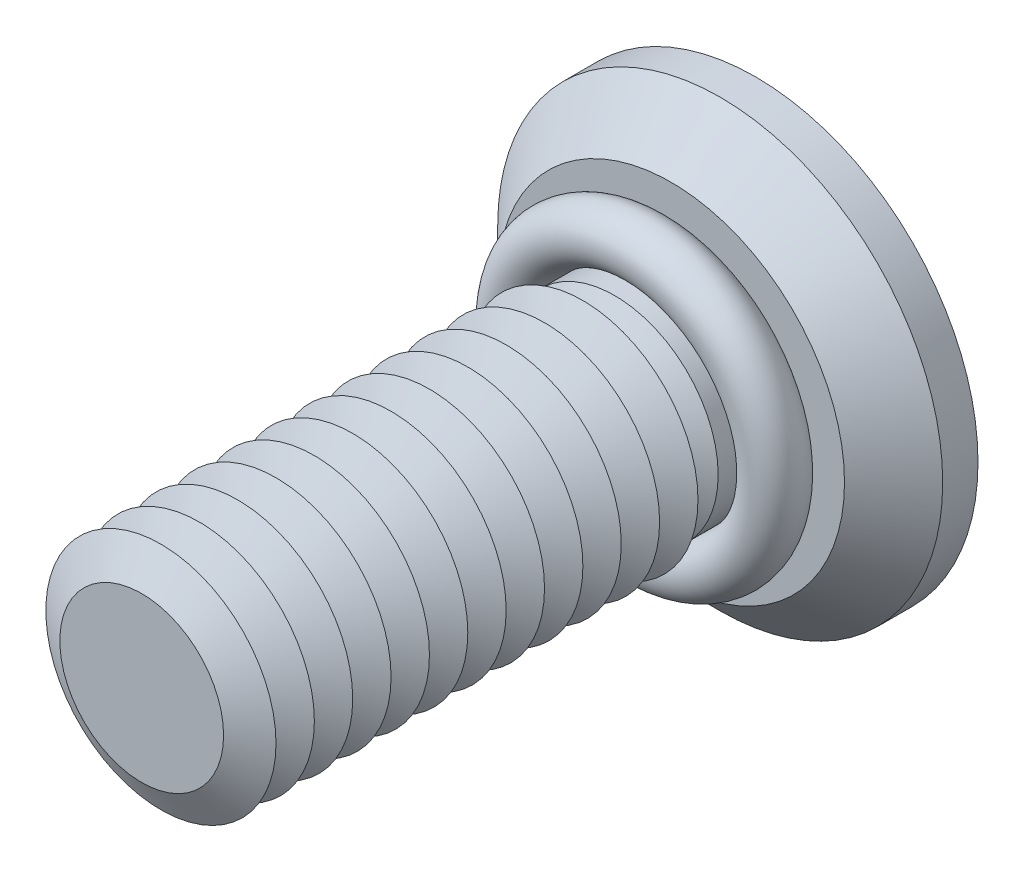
ISO-10303-21;
HEADER;
FILE_DESCRIPTION(('STEP AP214'),'2;1');
FILE_NAME('part.step','',(''),(''),'','','');
FILE_SCHEMA(('AUTOMOTIVE_DESIGN { 1 0 10303 214 1 1 1 1 }'));
ENDSEC;
DATA;
#1=APPLICATION_CONTEXT('core data for automotive mechanical design processes');
#2=APPLICATION_PROTOCOL_DEFINITION('international standard','automotive_design',2000,#1);
#3=PRODUCT_CONTEXT('',#1,'mechanical');
#4=PRODUCT('Part','Part','',(#3));
#5=PRODUCT_RELATED_PRODUCT_CATEGORY('part','',(#4));
#6=PRODUCT_DEFINITION_FORMATION('','',#4);
#7=PRODUCT_DEFINITION_CONTEXT('part definition',#1,'design');
#8=PRODUCT_DEFINITION('design','',#6,#7);
#9=PRODUCT_DEFINITION_SHAPE('','',#8);
#10=(LENGTH_UNIT() NAMED_UNIT(*) SI_UNIT(.MILLI.,.METRE.));
#11=(NAMED_UNIT(*) PLANE_ANGLE_UNIT() SI_UNIT($,.RADIAN.));
#12=(NAMED_UNIT(*) SI_UNIT($,.STERADIAN.) SOLID_ANGLE_UNIT());
#13=UNCERTAINTY_MEASURE_WITH_UNIT(LENGTH_MEASURE(1.E-05),#10,'distance_accuracy_value','');
#14=(GEOMETRIC_REPRESENTATION_CONTEXT(3) GLOBAL_UNCERTAINTY_ASSIGNED_CONTEXT((#13)) GLOBAL_UNIT_ASSIGNED_CONTEXT((#10,
#11,#12)) REPRESENTATION_CONTEXT('',''));
#15=CARTESIAN_POINT('',(0.,0.,0.));
#16=DIRECTION('',(0.,0.,1.));
#17=DIRECTION('',(1.,0.,0.));
#18=AXIS2_PLACEMENT_3D('',#15,#16,#17);
#19=CARTESIAN_POINT('',(0.,0.,1.45));
#20=DIRECTION('',(0.,0.,1.));
#21=DIRECTION('',(1.,0.,0.));
#22=AXIS2_PLACEMENT_3D('',#19,#20,#21);
#23=TOROIDAL_SURFACE('',#22,1.7,0.35);
#24=CARTESIAN_POINT('',(0.,1.7,1.45));
#25=DIRECTION('',(1.,0.,0.));
#26=DIRECTION('',(0.,0.,-1.));
#27=AXIS2_PLACEMENT_3D('',#24,#25,#26);
#28=CIRCLE('',#27,0.35);
#29=CARTESIAN_POINT('',(0.,2.05,1.45));
#30=VERTEX_POINT('',#29);
#31=EDGE_CURVE('P0_E10',#30,#30,#28,.T.);
#32=CARTESIAN_POINT('',(0.,0.,1.45));
#33=DIRECTION('',(0.,0.,1.));
#34=DIRECTION('',(1.,0.,0.));
#35=AXIS2_PLACEMENT_3D('',#32,#33,#34);
#36=CIRCLE('',#35,2.05);
#37=EDGE_CURVE('',#30,#30,#36,.T.);
#38=ORIENTED_EDGE('',*,*,#31,.F.);
#39=ORIENTED_EDGE('',*,*,#31,.T.);
#40=ORIENTED_EDGE('',*,*,#37,.T.);
#41=ORIENTED_EDGE('',*,*,#37,.F.);
#42=EDGE_LOOP('',(#38,#40,#39,#41));
#43=FACE_BOUND('',#42,.T.);
#44=ADVANCED_FACE('P0_F14',(#43),#23,.T.);
#45=CLOSED_SHELL('',(#44));
#46=MANIFOLD_SOLID_BREP('P0_B1',#45);
#47=CARTESIAN_POINT('',(0.,0.,5.5));
#48=DIRECTION('',(0.,0.,-1.));
#49=DIRECTION('',(-1.,0.,0.));
#50=AXIS2_PLACEMENT_3D('',#47,#48,#49);
#51=CONICAL_SURFACE('',#50,1.06698729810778,1.0471975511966);
#52=CARTESIAN_POINT('',(0.,0.,5.25));
#53=DIRECTION('',(0.,0.,1.));
#54=DIRECTION('',(1.,0.,0.));
#55=AXIS2_PLACEMENT_3D('',#52,#53,#54);
#56=CIRCLE('',#55,1.5);
#57=CARTESIAN_POINT('',(1.5,0.,5.25));
#58=VERTEX_POINT('',#57);
#59=EDGE_CURVE('P1_E324',#58,#58,#56,.T.);
#60=ORIENTED_EDGE('',*,*,#59,.T.);
#61=EDGE_LOOP('',(#60));
#62=FACE_BOUND('',#61,.T.);
#63=CARTESIAN_POINT('',(0.,0.,5.5));
#64=DIRECTION('',(0.,0.,1.));
#65=DIRECTION('',(1.,0.,0.));
#66=AXIS2_PLACEMENT_3D('',#63,#64,#65);
#67=CIRCLE('',#66,1.06698729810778);
#68=CARTESIAN_POINT('',(1.06698729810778,0.,5.5));
#69=VERTEX_POINT('',#68);
#70=EDGE_CURVE('P1_E321',#69,#69,#67,.T.);
#71=ORIENTED_EDGE('',*,*,#70,.F.);
#72=EDGE_LOOP('',(#71));
#73=FACE_BOUND('',#72,.T.);
#74=ADVANCED_FACE('P1_F15',(#62,#73),#51,.T.);
#75=CARTESIAN_POINT('',(0.,0.,5.75));
#76=DIRECTION('',(0.,0.,1.));
#77=DIRECTION('',(1.,0.,0.));
#78=AXIS2_PLACEMENT_3D('',#75,#76,#77);
#79=CONICAL_SURFACE('',#78,1.5,1.0471975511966);
#80=ORIENTED_EDGE('',*,*,#70,.T.);
#81=EDGE_LOOP('',(#80));
#82=FACE_BOUND('',#81,.T.);
#83=CARTESIAN_POINT('',(0.,0.,5.75));
#84=DIRECTION('',(0.,0.,1.));
#85=DIRECTION('',(1.,0.,0.));
#86=AXIS2_PLACEMENT_3D('',#83,#84,#85);
#87=CIRCLE('',#86,1.5);
#88=CARTESIAN_POINT('',(1.5,0.,5.75));
#89=VERTEX_POINT('',#88);
#90=EDGE_CURVE('P1_E318',#89,#89,#87,.T.);
#91=ORIENTED_EDGE('',*,*,#90,.F.);
#92=EDGE_LOOP('',(#91));
#93=FACE_BOUND('',#92,.T.);
#94=ADVANCED_FACE('P1_F245',(#82,#93),#79,.T.);
#95=CARTESIAN_POINT('',(0.,0.,8.));
#96=DIRECTION('',(0.,0.,1.));
#97=DIRECTION('',(1.,0.,0.));
#98=AXIS2_PLACEMENT_3D('',#95,#96,#97);
#99=PLANE('',#98);
#100=CARTESIAN_POINT('',(0.,0.,8.));
#101=DIRECTION('',(0.,0.,1.));
#102=DIRECTION('',(1.,0.,0.));
#103=AXIS2_PLACEMENT_3D('',#100,#101,#102);
#104=CIRCLE('',#103,1.06698729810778);
#105=CARTESIAN_POINT('',(1.06698729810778,0.,8.));
#106=VERTEX_POINT('',#105);
#107=EDGE_CURVE('P1_E131',#106,#106,#104,.T.);
#108=ORIENTED_EDGE('',*,*,#107,.T.);
#109=EDGE_LOOP('',(#108));
#110=FACE_BOUND('',#109,.T.);
#111=ADVANCED_FACE('P1_F251',(#110),#99,.T.);
#112=CARTESIAN_POINT('',(0.,0.,8.));
#113=DIRECTION('',(0.,0.,-1.));
#114=DIRECTION('',(-1.,0.,0.));
#115=AXIS2_PLACEMENT_3D('',#112,#113,#114);
#116=CONICAL_SURFACE('',#115,1.06698729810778,1.0471975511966);
#117=CARTESIAN_POINT('',(0.,0.,7.75));
#118=DIRECTION('',(0.,0.,1.));
#119=DIRECTION('',(1.,0.,0.));
#120=AXIS2_PLACEMENT_3D('',#117,#118,#119);
#121=CIRCLE('',#120,1.5);
#122=CARTESIAN_POINT('',(1.5,0.,7.75));
#123=VERTEX_POINT('',#122);
#124=EDGE_CURVE('P1_E133',#123,#123,#121,.T.);
#125=ORIENTED_EDGE('',*,*,#124,.T.);
#126=EDGE_LOOP('',(#125));
#127=FACE_BOUND('',#126,.T.);
#128=ORIENTED_EDGE('',*,*,#107,.F.);
#129=EDGE_LOOP('',(#128));
#130=FACE_BOUND('',#129,.T.);
#131=ADVANCED_FACE('P1_F196',(#127,#130),#116,.T.);
#132=CARTESIAN_POINT('',(0.,0.,7.75));
#133=DIRECTION('',(0.,0.,1.));
#134=DIRECTION('',(1.,0.,0.));
#135=AXIS2_PLACEMENT_3D('',#132,#133,#134);
#136=CONICAL_SURFACE('',#135,1.5,1.0471975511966);
#137=CARTESIAN_POINT('',(0.,0.,7.5));
#138=DIRECTION('',(0.,0.,1.));
#139=DIRECTION('',(1.,0.,0.));
#140=AXIS2_PLACEMENT_3D('',#137,#138,#139);
#141=CIRCLE('',#140,1.06698729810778);
#142=CARTESIAN_POINT('',(1.06698729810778,0.,7.5));
#143=VERTEX_POINT('',#142);
#144=EDGE_CURVE('P1_E297',#143,#143,#141,.T.);
#145=ORIENTED_EDGE('',*,*,#144,.T.);
#146=EDGE_LOOP('',(#145));
#147=FACE_BOUND('',#146,.T.);
#148=ORIENTED_EDGE('',*,*,#124,.F.);
#149=EDGE_LOOP('',(#148));
#150=FACE_BOUND('',#149,.T.);
#151=ADVANCED_FACE('P1_F284',(#147,#150),#136,.T.);
#152=CARTESIAN_POINT('',(0.,0.,7.5));
#153=DIRECTION('',(0.,0.,-1.));
#154=DIRECTION('',(-1.,0.,0.));
#155=AXIS2_PLACEMENT_3D('',#152,#153,#154);
#156=CONICAL_SURFACE('',#155,1.06698729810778,1.0471975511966);
#157=CARTESIAN_POINT('',(0.,0.,7.25));
#158=DIRECTION('',(0.,0.,1.));
#159=DIRECTION('',(1.,0.,0.));
#160=AXIS2_PLACEMENT_3D('',#157,#158,#159);
#161=CIRCLE('',#160,1.5);
#162=CARTESIAN_POINT('',(1.5,0.,7.25));
#163=VERTEX_POINT('',#162);
#164=EDGE_CURVE('P1_E294',#163,#163,#161,.T.);
#165=ORIENTED_EDGE('',*,*,#164,.T.);
#166=EDGE_LOOP('',(#165));
#167=FACE_BOUND('',#166,.T.);
#168=ORIENTED_EDGE('',*,*,#144,.F.);
#169=EDGE_LOOP('',(#168));
#170=FACE_BOUND('',#169,.T.);
#171=ADVANCED_FACE('P1_F279',(#167,#170),#156,.T.);
#172=CARTESIAN_POINT('',(0.,0.,7.25));
#173=DIRECTION('',(0.,0.,1.));
#174=DIRECTION('',(1.,0.,0.));
#175=AXIS2_PLACEMENT_3D('',#172,#173,#174);
#176=CONICAL_SURFACE('',#175,1.5,1.0471975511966);
#177=CARTESIAN_POINT('',(0.,0.,7.));
#178=DIRECTION('',(0.,0.,1.));
#179=DIRECTION('',(1.,0.,0.));
#180=AXIS2_PLACEMENT_3D('',#177,#178,#179);
#181=CIRCLE('',#180,1.06698729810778);
#182=CARTESIAN_POINT('',(1.06698729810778,0.,7.));
#183=VERTEX_POINT('',#182);
#184=EDGE_CURVE('P1_E301',#183,#183,#181,.T.);
#185=ORIENTED_EDGE('',*,*,#184,.T.);
#186=EDGE_LOOP('',(#185));
#187=FACE_BOUND('',#186,.T.);
#188=ORIENTED_EDGE('',*,*,#164,.F.);
#189=EDGE_LOOP('',(#188));
#190=FACE_BOUND('',#189,.T.);
#191=ADVANCED_FACE('P1_F276',(#187,#190),#176,.T.);
#192=CARTESIAN_POINT('',(0.,0.,7.));
#193=DIRECTION('',(0.,0.,-1.));
#194=DIRECTION('',(-1.,0.,0.));
#195=AXIS2_PLACEMENT_3D('',#192,#193,#194);
#196=CONICAL_SURFACE('',#195,1.06698729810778,1.0471975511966);
#197=CARTESIAN_POINT('',(0.,0.,6.75));
#198=DIRECTION('',(0.,0.,1.));
#199=DIRECTION('',(1.,0.,0.));
#200=AXIS2_PLACEMENT_3D('',#197,#198,#199);
#201=CIRCLE('',#200,1.5);
#202=CARTESIAN_POINT('',(1.5,0.,6.75));
#203=VERTEX_POINT('',#202);
#204=EDGE_CURVE('P1_E306',#203,#203,#201,.T.);
#205=ORIENTED_EDGE('',*,*,#204,.T.);
#206=EDGE_LOOP('',(#205));
#207=FACE_BOUND('',#206,.T.);
#208=ORIENTED_EDGE('',*,*,#184,.F.);
#209=EDGE_LOOP('',(#208));
#210=FACE_BOUND('',#209,.T.);
#211=ADVANCED_FACE('P1_F271',(#207,#210),#196,.T.);
#212=CARTESIAN_POINT('',(0.,0.,6.75));
#213=DIRECTION('',(0.,0.,1.));
#214=DIRECTION('',(1.,0.,0.));
#215=AXIS2_PLACEMENT_3D('',#212,#213,#214);
#216=CONICAL_SURFACE('',#215,1.5,1.0471975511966);
#217=CARTESIAN_POINT('',(0.,0.,6.5));
#218=DIRECTION('',(0.,0.,1.));
#219=DIRECTION('',(1.,0.,0.));
#220=AXIS2_PLACEMENT_3D('',#217,#218,#219);
#221=CIRCLE('',#220,1.06698729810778);
#222=CARTESIAN_POINT('',(1.06698729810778,0.,6.5));
#223=VERTEX_POINT('',#222);
#224=EDGE_CURVE('P1_E309',#223,#223,#221,.T.);
#225=ORIENTED_EDGE('',*,*,#224,.T.);
#226=EDGE_LOOP('',(#225));
#227=FACE_BOUND('',#226,.T.);
#228=ORIENTED_EDGE('',*,*,#204,.F.);
#229=EDGE_LOOP('',(#228));
#230=FACE_BOUND('',#229,.T.);
#231=ADVANCED_FACE('P1_F268',(#227,#230),#216,.T.);
#232=CARTESIAN_POINT('',(0.,0.,6.5));
#233=DIRECTION('',(0.,0.,-1.));
#234=DIRECTION('',(-1.,0.,0.));
#235=AXIS2_PLACEMENT_3D('',#232,#233,#234);
#236=CONICAL_SURFACE('',#235,1.06698729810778,1.0471975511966);
#237=CARTESIAN_POINT('',(0.,0.,6.25));
#238=DIRECTION('',(0.,0.,1.));
#239=DIRECTION('',(1.,0.,0.));
#240=AXIS2_PLACEMENT_3D('',#237,#238,#239);
#241=CIRCLE('',#240,1.5);
#242=CARTESIAN_POINT('',(1.5,0.,6.25));
#243=VERTEX_POINT('',#242);
#244=EDGE_CURVE('P1_E312',#243,#243,#241,.T.);
#245=ORIENTED_EDGE('',*,*,#244,.T.);
#246=EDGE_LOOP('',(#245));
#247=FACE_BOUND('',#246,.T.);
#248=ORIENTED_EDGE('',*,*,#224,.F.);
#249=EDGE_LOOP('',(#248));
#250=FACE_BOUND('',#249,.T.);
#251=ADVANCED_FACE('P1_F262',(#247,#250),#236,.T.);
#252=CARTESIAN_POINT('',(0.,0.,6.25));
#253=DIRECTION('',(0.,0.,1.));
#254=DIRECTION('',(1.,0.,0.));
#255=AXIS2_PLACEMENT_3D('',#252,#253,#254);
#256=CONICAL_SURFACE('',#255,1.5,1.0471975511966);
#257=CARTESIAN_POINT('',(0.,0.,6.));
#258=DIRECTION('',(0.,0.,1.));
#259=DIRECTION('',(1.,0.,0.));
#260=AXIS2_PLACEMENT_3D('',#257,#258,#259);
#261=CIRCLE('',#260,1.06698729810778);
#262=CARTESIAN_POINT('',(1.06698729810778,0.,6.));
#263=VERTEX_POINT('',#262);
#264=EDGE_CURVE('P1_E315',#263,#263,#261,.T.);
#265=ORIENTED_EDGE('',*,*,#264,.T.);
#266=EDGE_LOOP('',(#265));
#267=FACE_BOUND('',#266,.T.);
#268=ORIENTED_EDGE('',*,*,#244,.F.);
#269=EDGE_LOOP('',(#268));
#270=FACE_BOUND('',#269,.T.);
#271=ADVANCED_FACE('P1_F258',(#267,#270),#256,.T.);
#272=CARTESIAN_POINT('',(0.,0.,6.));
#273=DIRECTION('',(0.,0.,-1.));
#274=DIRECTION('',(-1.,0.,0.));
#275=AXIS2_PLACEMENT_3D('',#272,#273,#274);
#276=CONICAL_SURFACE('',#275,1.06698729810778,1.0471975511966);
#277=ORIENTED_EDGE('',*,*,#90,.T.);
#278=EDGE_LOOP('',(#277));
#279=FACE_BOUND('',#278,.T.);
#280=ORIENTED_EDGE('',*,*,#264,.F.);
#281=EDGE_LOOP('',(#280));
#282=FACE_BOUND('',#281,.T.);
#283=ADVANCED_FACE('P1_F261',(#279,#282),#276,.T.);
#284=CARTESIAN_POINT('',(0.,0.,5.));
#285=DIRECTION('',(0.,0.,-1.));
#286=DIRECTION('',(-1.,0.,0.));
#287=AXIS2_PLACEMENT_3D('',#284,#285,#286);
#288=CONICAL_SURFACE('',#287,1.06698729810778,1.0471975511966);
#289=CARTESIAN_POINT('',(0.,0.,4.75));
#290=DIRECTION('',(0.,0.,1.));
#291=DIRECTION('',(1.,0.,0.));
#292=AXIS2_PLACEMENT_3D('',#289,#290,#291);
#293=CIRCLE('',#292,1.5);
#294=CARTESIAN_POINT('',(1.5,0.,4.75));
#295=VERTEX_POINT('',#294);
#296=EDGE_CURVE('P1_E329',#295,#295,#293,.T.);
#297=ORIENTED_EDGE('',*,*,#296,.T.);
#298=EDGE_LOOP('',(#297));
#299=FACE_BOUND('',#298,.T.);
#300=CARTESIAN_POINT('',(0.,0.,5.));
#301=DIRECTION('',(0.,0.,1.));
#302=DIRECTION('',(1.,0.,0.));
#303=AXIS2_PLACEMENT_3D('',#300,#301,#302);
#304=CIRCLE('',#303,1.06698729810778);
#305=CARTESIAN_POINT('',(1.06698729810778,0.,5.));
#306=VERTEX_POINT('',#305);
#307=EDGE_CURVE('P1_E326',#306,#306,#304,.T.);
#308=ORIENTED_EDGE('',*,*,#307,.F.);
#309=EDGE_LOOP('',(#308));
#310=FACE_BOUND('',#309,.T.);
#311=ADVANCED_FACE('P1_F266',(#299,#310),#288,.T.);
#312=CARTESIAN_POINT('',(0.,0.,5.25));
#313=DIRECTION('',(0.,0.,1.));
#314=DIRECTION('',(1.,0.,0.));
#315=AXIS2_PLACEMENT_3D('',#312,#313,#314);
#316=CONICAL_SURFACE('',#315,1.5,1.0471975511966);
#317=ORIENTED_EDGE('',*,*,#307,.T.);
#318=EDGE_LOOP('',(#317));
#319=FACE_BOUND('',#318,.T.);
#320=ORIENTED_EDGE('',*,*,#59,.F.);
#321=EDGE_LOOP('',(#320));
#322=FACE_BOUND('',#321,.T.);
#323=ADVANCED_FACE('P1_F467',(#319,#322),#316,.T.);
#324=CARTESIAN_POINT('',(0.,0.,4.5));
#325=DIRECTION('',(0.,0.,-1.));
#326=DIRECTION('',(-1.,0.,0.));
#327=AXIS2_PLACEMENT_3D('',#324,#325,#326);
#328=CONICAL_SURFACE('',#327,1.06698729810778,1.0471975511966);
#329=CARTESIAN_POINT('',(0.,0.,4.25));
#330=DIRECTION('',(0.,0.,1.));
#331=DIRECTION('',(1.,0.,0.));
#332=AXIS2_PLACEMENT_3D('',#329,#330,#331);
#333=CIRCLE('',#332,1.5);
#334=CARTESIAN_POINT('',(1.5,0.,4.25));
#335=VERTEX_POINT('',#334);
#336=EDGE_CURVE('P1_E335',#335,#335,#333,.T.);
#337=ORIENTED_EDGE('',*,*,#336,.T.);
#338=EDGE_LOOP('',(#337));
#339=FACE_BOUND('',#338,.T.);
#340=CARTESIAN_POINT('',(0.,0.,4.5));
#341=DIRECTION('',(0.,0.,1.));
#342=DIRECTION('',(1.,0.,0.));
#343=AXIS2_PLACEMENT_3D('',#340,#341,#342);
#344=CIRCLE('',#343,1.06698729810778);
#345=CARTESIAN_POINT('',(1.06698729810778,0.,4.5));
#346=VERTEX_POINT('',#345);
#347=EDGE_CURVE('P1_E332',#346,#346,#344,.T.);
#348=ORIENTED_EDGE('',*,*,#347,.F.);
#349=EDGE_LOOP('',(#348));
#350=FACE_BOUND('',#349,.T.);
#351=ADVANCED_FACE('P1_F476',(#339,#350),#328,.T.);
#352=CARTESIAN_POINT('',(0.,0.,4.75));
#353=DIRECTION('',(0.,0.,1.));
#354=DIRECTION('',(1.,0.,0.));
#355=AXIS2_PLACEMENT_3D('',#352,#353,#354);
#356=CONICAL_SURFACE('',#355,1.5,1.0471975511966);
#357=ORIENTED_EDGE('',*,*,#347,.T.);
#358=EDGE_LOOP('',(#357));
#359=FACE_BOUND('',#358,.T.);
#360=ORIENTED_EDGE('',*,*,#296,.F.);
#361=EDGE_LOOP('',(#360));
#362=FACE_BOUND('',#361,.T.);
#363=ADVANCED_FACE('P1_F486',(#359,#362),#356,.T.);
#364=CARTESIAN_POINT('',(0.,0.,4.));
#365=DIRECTION('',(0.,0.,-1.));
#366=DIRECTION('',(-1.,0.,0.));
#367=AXIS2_PLACEMENT_3D('',#364,#365,#366);
#368=CONICAL_SURFACE('',#367,1.06698729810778,1.0471975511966);
#369=CARTESIAN_POINT('',(0.,0.,3.75));
#370=DIRECTION('',(0.,0.,1.));
#371=DIRECTION('',(1.,0.,0.));
#372=AXIS2_PLACEMENT_3D('',#369,#370,#371);
#373=CIRCLE('',#372,1.5);
#374=CARTESIAN_POINT('',(1.5,0.,3.75));
#375=VERTEX_POINT('',#374);
#376=EDGE_CURVE('P1_E341',#375,#375,#373,.T.);
#377=ORIENTED_EDGE('',*,*,#376,.T.);
#378=EDGE_LOOP('',(#377));
#379=FACE_BOUND('',#378,.T.);
#380=CARTESIAN_POINT('',(0.,0.,4.));
#381=DIRECTION('',(0.,0.,1.));
#382=DIRECTION('',(1.,0.,0.));
#383=AXIS2_PLACEMENT_3D('',#380,#381,#382);
#384=CIRCLE('',#383,1.06698729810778);
#385=CARTESIAN_POINT('',(1.06698729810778,0.,4.));
#386=VERTEX_POINT('',#385);
#387=EDGE_CURVE('P1_E338',#386,#386,#384,.T.);
#388=ORIENTED_EDGE('',*,*,#387,.F.);
#389=EDGE_LOOP('',(#388));
#390=FACE_BOUND('',#389,.T.);
#391=ADVANCED_FACE('P1_F496',(#379,#390),#368,.T.);
#392=CARTESIAN_POINT('',(0.,0.,4.25));
#393=DIRECTION('',(0.,0.,1.));
#394=DIRECTION('',(1.,0.,0.));
#395=AXIS2_PLACEMENT_3D('',#392,#393,#394);
#396=CONICAL_SURFACE('',#395,1.5,1.0471975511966);
#397=ORIENTED_EDGE('',*,*,#387,.T.);
#398=EDGE_LOOP('',(#397));
#399=FACE_BOUND('',#398,.T.);
#400=ORIENTED_EDGE('',*,*,#336,.F.);
#401=EDGE_LOOP('',(#400));
#402=FACE_BOUND('',#401,.T.);
#403=ADVANCED_FACE('P1_F506',(#399,#402),#396,.T.);
#404=CARTESIAN_POINT('',(0.,0.,3.5));
#405=DIRECTION('',(0.,0.,-1.));
#406=DIRECTION('',(-1.,0.,0.));
#407=AXIS2_PLACEMENT_3D('',#404,#405,#406);
#408=CONICAL_SURFACE('',#407,1.06698729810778,1.0471975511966);
#409=CARTESIAN_POINT('',(0.,0.,3.25));
#410=DIRECTION('',(0.,0.,1.));
#411=DIRECTION('',(1.,0.,0.));
#412=AXIS2_PLACEMENT_3D('',#409,#410,#411);
#413=CIRCLE('',#412,1.5);
#414=CARTESIAN_POINT('',(1.5,0.,3.25));
#415=VERTEX_POINT('',#414);
#416=EDGE_CURVE('P1_E347',#415,#415,#413,.T.);
#417=ORIENTED_EDGE('',*,*,#416,.T.);
#418=EDGE_LOOP('',(#417));
#419=FACE_BOUND('',#418,.T.);
#420=CARTESIAN_POINT('',(0.,0.,3.5));
#421=DIRECTION('',(0.,0.,1.));
#422=DIRECTION('',(1.,0.,0.));
#423=AXIS2_PLACEMENT_3D('',#420,#421,#422);
#424=CIRCLE('',#423,1.06698729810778);
#425=CARTESIAN_POINT('',(1.06698729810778,0.,3.5));
#426=VERTEX_POINT('',#425);
#427=EDGE_CURVE('P1_E344',#426,#426,#424,.T.);
#428=ORIENTED_EDGE('',*,*,#427,.F.);
#429=EDGE_LOOP('',(#428));
#430=FACE_BOUND('',#429,.T.);
#431=ADVANCED_FACE('P1_F516',(#419,#430),#408,.T.);
#432=CARTESIAN_POINT('',(0.,0.,3.75));
#433=DIRECTION('',(0.,0.,1.));
#434=DIRECTION('',(1.,0.,0.));
#435=AXIS2_PLACEMENT_3D('',#432,#433,#434);
#436=CONICAL_SURFACE('',#435,1.5,1.0471975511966);
#437=ORIENTED_EDGE('',*,*,#427,.T.);
#438=EDGE_LOOP('',(#437));
#439=FACE_BOUND('',#438,.T.);
#440=ORIENTED_EDGE('',*,*,#376,.F.);
#441=EDGE_LOOP('',(#440));
#442=FACE_BOUND('',#441,.T.);
#443=ADVANCED_FACE('P1_F526',(#439,#442),#436,.T.);
#444=CARTESIAN_POINT('',(0.,0.,3.));
#445=DIRECTION('',(0.,0.,-1.));
#446=DIRECTION('',(-1.,0.,0.));
#447=AXIS2_PLACEMENT_3D('',#444,#445,#446);
#448=CONICAL_SURFACE('',#447,1.06698729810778,1.0471975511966);
#449=CARTESIAN_POINT('',(0.,0.,2.75));
#450=DIRECTION('',(0.,0.,1.));
#451=DIRECTION('',(1.,0.,0.));
#452=AXIS2_PLACEMENT_3D('',#449,#450,#451);
#453=CIRCLE('',#452,1.5);
#454=CARTESIAN_POINT('',(1.5,0.,2.75));
#455=VERTEX_POINT('',#454);
#456=EDGE_CURVE('P1_E353',#455,#455,#453,.T.);
#457=ORIENTED_EDGE('',*,*,#456,.T.);
#458=EDGE_LOOP('',(#457));
#459=FACE_BOUND('',#458,.T.);
#460=CARTESIAN_POINT('',(0.,0.,3.));
#461=DIRECTION('',(0.,0.,1.));
#462=DIRECTION('',(1.,0.,0.));
#463=AXIS2_PLACEMENT_3D('',#460,#461,#462);
#464=CIRCLE('',#463,1.06698729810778);
#465=CARTESIAN_POINT('',(1.06698729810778,0.,3.));
#466=VERTEX_POINT('',#465);
#467=EDGE_CURVE('P1_E350',#466,#466,#464,.T.);
#468=ORIENTED_EDGE('',*,*,#467,.F.);
#469=EDGE_LOOP('',(#468));
#470=FACE_BOUND('',#469,.T.);
#471=ADVANCED_FACE('P1_F536',(#459,#470),#448,.T.);
#472=CARTESIAN_POINT('',(0.,0.,3.25));
#473=DIRECTION('',(0.,0.,1.));
#474=DIRECTION('',(1.,0.,0.));
#475=AXIS2_PLACEMENT_3D('',#472,#473,#474);
#476=CONICAL_SURFACE('',#475,1.5,1.0471975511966);
#477=ORIENTED_EDGE('',*,*,#467,.T.);
#478=EDGE_LOOP('',(#477));
#479=FACE_BOUND('',#478,.T.);
#480=ORIENTED_EDGE('',*,*,#416,.F.);
#481=EDGE_LOOP('',(#480));
#482=FACE_BOUND('',#481,.T.);
#483=ADVANCED_FACE('P1_F546',(#479,#482),#476,.T.);
#484=CARTESIAN_POINT('',(0.,0.,2.5));
#485=DIRECTION('',(0.,0.,-1.));
#486=DIRECTION('',(-1.,0.,0.));
#487=AXIS2_PLACEMENT_3D('',#484,#485,#486);
#488=CONICAL_SURFACE('',#487,1.06698729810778,1.0471975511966);
#489=CARTESIAN_POINT('',(0.,0.,2.25));
#490=DIRECTION('',(0.,0.,1.));
#491=DIRECTION('',(1.,0.,0.));
#492=AXIS2_PLACEMENT_3D('',#489,#490,#491);
#493=CIRCLE('',#492,1.5);
#494=CARTESIAN_POINT('',(1.5,0.,2.25));
#495=VERTEX_POINT('',#494);
#496=EDGE_CURVE('P1_E359',#495,#495,#493,.T.);
#497=ORIENTED_EDGE('',*,*,#496,.T.);
#498=EDGE_LOOP('',(#497));
#499=FACE_BOUND('',#498,.T.);
#500=CARTESIAN_POINT('',(0.,0.,2.5));
#501=DIRECTION('',(0.,0.,1.));
#502=DIRECTION('',(1.,0.,0.));
#503=AXIS2_PLACEMENT_3D('',#500,#501,#502);
#504=CIRCLE('',#503,1.06698729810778);
#505=CARTESIAN_POINT('',(1.06698729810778,0.,2.5));
#506=VERTEX_POINT('',#505);
#507=EDGE_CURVE('P1_E356',#506,#506,#504,.T.);
#508=ORIENTED_EDGE('',*,*,#507,.F.);
#509=EDGE_LOOP('',(#508));
#510=FACE_BOUND('',#509,.T.);
#511=ADVANCED_FACE('P1_F556',(#499,#510),#488,.T.);
#512=CARTESIAN_POINT('',(0.,0.,2.75));
#513=DIRECTION('',(0.,0.,1.));
#514=DIRECTION('',(1.,0.,0.));
#515=AXIS2_PLACEMENT_3D('',#512,#513,#514);
#516=CONICAL_SURFACE('',#515,1.5,1.0471975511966);
#517=ORIENTED_EDGE('',*,*,#507,.T.);
#518=EDGE_LOOP('',(#517));
#519=FACE_BOUND('',#518,.T.);
#520=ORIENTED_EDGE('',*,*,#456,.F.);
#521=EDGE_LOOP('',(#520));
#522=FACE_BOUND('',#521,.T.);
#523=ADVANCED_FACE('P1_F372',(#519,#522),#516,.T.);
#524=CARTESIAN_POINT('',(0.,0.,2.));
#525=DIRECTION('',(0.,0.,-1.));
#526=DIRECTION('',(-1.,0.,0.));
#527=AXIS2_PLACEMENT_3D('',#524,#525,#526);
#528=CONICAL_SURFACE('',#527,1.06698729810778,1.0471975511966);
#529=CARTESIAN_POINT('',(0.,0.,2.));
#530=DIRECTION('',(0.,0.,1.));
#531=DIRECTION('',(1.,0.,0.));
#532=AXIS2_PLACEMENT_3D('',#529,#530,#531);
#533=CIRCLE('',#532,1.06698729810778);
#534=CARTESIAN_POINT('',(1.06698729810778,0.,2.));
#535=VERTEX_POINT('',#534);
#536=EDGE_CURVE('P1_E362',#535,#535,#533,.T.);
#537=ORIENTED_EDGE('',*,*,#536,.F.);
#538=EDGE_LOOP('',(#537));
#539=FACE_BOUND('',#538,.T.);
#540=CARTESIAN_POINT('',(0.,0.,1.83660254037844));
#541=DIRECTION('',(0.,0.,-1.));
#542=DIRECTION('',(-1.,0.,0.));
#543=AXIS2_PLACEMENT_3D('',#540,#541,#542);
#544=CIRCLE('',#543,1.35);
#545=CARTESIAN_POINT('',(-1.35,0.,1.83660254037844));
#546=VERTEX_POINT('',#545);
#547=EDGE_CURVE('P1_E19',#546,#546,#544,.F.);
#548=ORIENTED_EDGE('',*,*,#547,.T.);
#549=EDGE_LOOP('',(#548));
#550=FACE_BOUND('',#549,.T.);
#551=ADVANCED_FACE('P1_F369',(#539,#550),#528,.T.);
#552=CARTESIAN_POINT('',(0.,0.,2.25));
#553=DIRECTION('',(0.,0.,1.));
#554=DIRECTION('',(1.,0.,0.));
#555=AXIS2_PLACEMENT_3D('',#552,#553,#554);
#556=CONICAL_SURFACE('',#555,1.5,1.0471975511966);
#557=ORIENTED_EDGE('',*,*,#536,.T.);
#558=EDGE_LOOP('',(#557));
#559=FACE_BOUND('',#558,.T.);
#560=ORIENTED_EDGE('',*,*,#496,.F.);
#561=EDGE_LOOP('',(#560));
#562=FACE_BOUND('',#561,.T.);
#563=ADVANCED_FACE('P1_F366',(#559,#562),#556,.T.);
#564=CARTESIAN_POINT('',(0.,0.,1.2));
#565=DIRECTION('',(0.,0.,-1.));
#566=DIRECTION('',(-1.,0.,0.));
#567=AXIS2_PLACEMENT_3D('',#564,#565,#566);
#568=CONICAL_SURFACE('',#567,1.,1.0471975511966);
#569=CARTESIAN_POINT('',(0.,0.,1.77735026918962));
#570=VERTEX_POINT('',#569);
#571=VERTEX_LOOP('',#570);
#572=FACE_BOUND('',#571,.T.);
#573=CARTESIAN_POINT('',(0.,0.,1.2));
#574=DIRECTION('',(0.,0.,-1.));
#575=DIRECTION('',(-1.,0.,0.));
#576=AXIS2_PLACEMENT_3D('',#573,#574,#575);
#577=CIRCLE('',#576,1.);
#578=CARTESIAN_POINT('',(-1.,0.,1.2));
#579=VERTEX_POINT('',#578);
#580=CARTESIAN_POINT('',(-0.5,0.866025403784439,1.2));
#581=VERTEX_POINT('',#580);
#582=EDGE_CURVE('P1_E117',#579,#581,#577,.T.);
#583=ORIENTED_EDGE('',*,*,#582,.T.);
#584=CARTESIAN_POINT('',(0.,0.,1.2));
#585=DIRECTION('',(0.,0.,-1.));
#586=DIRECTION('',(-1.,0.,0.));
#587=AXIS2_PLACEMENT_3D('',#584,#585,#586);
#588=CIRCLE('',#587,1.);
#589=CARTESIAN_POINT('',(0.5,0.866025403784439,1.2));
#590=VERTEX_POINT('',#589);
#591=EDGE_CURVE('P1_E24',#581,#590,#588,.T.);
#592=ORIENTED_EDGE('',*,*,#591,.T.);
#593=CARTESIAN_POINT('',(1.,0.,1.2));
#594=VERTEX_POINT('',#593);
#595=EDGE_CURVE('P1_E791',#590,#594,#588,.T.);
#596=ORIENTED_EDGE('',*,*,#595,.T.);
#597=CARTESIAN_POINT('',(0.5,-0.866025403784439,1.2));
#598=VERTEX_POINT('',#597);
#599=EDGE_CURVE('P1_E784',#594,#598,#588,.T.);
#600=ORIENTED_EDGE('',*,*,#599,.T.);
#601=CARTESIAN_POINT('',(-0.499999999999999,-0.866025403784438,1.2));
#602=VERTEX_POINT('',#601);
#603=EDGE_CURVE('P1_E182',#598,#602,#588,.T.);
#604=ORIENTED_EDGE('',*,*,#603,.T.);
#605=EDGE_CURVE('P1_E179',#602,#579,#588,.T.);
#606=ORIENTED_EDGE('',*,*,#605,.T.);
#607=EDGE_LOOP('',(#583,#592,#596,#600,#604,#606));
#608=FACE_BOUND('',#607,.T.);
#609=ADVANCED_FACE('P1_F198',(#572,#608),#568,.F.);
#610=CARTESIAN_POINT('',(0.,0.,1.2));
#611=DIRECTION('',(0.,0.,-1.));
#612=DIRECTION('',(-1.,0.,0.));
#613=AXIS2_PLACEMENT_3D('',#610,#611,#612);
#614=PLANE('',#613);
#615=ORIENTED_EDGE('',*,*,#603,.F.);
#616=DIRECTION('',(-0.866025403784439,-0.5,0.));
#617=VECTOR('',#616,1.);
#618=CARTESIAN_POINT('',(1.,-0.577350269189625,1.2));
#619=LINE('',#618,#617);
#620=CARTESIAN_POINT('',(0.,-1.15470053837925,1.2));
#621=VERTEX_POINT('',#620);
#622=EDGE_CURVE('P1_E800',#598,#621,#619,.T.);
#623=ORIENTED_EDGE('',*,*,#622,.T.);
#624=DIRECTION('',(-0.866025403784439,0.5,0.));
#625=VECTOR('',#624,1.);
#626=CARTESIAN_POINT('',(0.,-1.15470053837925,1.2));
#627=LINE('',#626,#625);
#628=EDGE_CURVE('P1_E807',#621,#602,#627,.T.);
#629=ORIENTED_EDGE('',*,*,#628,.T.);
#630=EDGE_LOOP('',(#615,#623,#629));
#631=FACE_BOUND('',#630,.T.);
#632=ADVANCED_FACE('P1_F598',(#631),#614,.T.);
#633=ORIENTED_EDGE('',*,*,#605,.F.);
#634=CARTESIAN_POINT('',(-1.,-0.577350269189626,1.2));
#635=VERTEX_POINT('',#634);
#636=EDGE_CURVE('P1_E810',#602,#635,#627,.T.);
#637=ORIENTED_EDGE('',*,*,#636,.T.);
#638=DIRECTION('',(0.,1.,0.));
#639=VECTOR('',#638,1.);
#640=CARTESIAN_POINT('',(-1.,-0.577350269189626,1.2));
#641=LINE('',#640,#639);
#642=EDGE_CURVE('P1_E123',#635,#579,#641,.T.);
#643=ORIENTED_EDGE('',*,*,#642,.T.);
#644=EDGE_LOOP('',(#633,#637,#643));
#645=FACE_BOUND('',#644,.T.);
#646=ADVANCED_FACE('P1_F231',(#645),#614,.T.);
#647=ORIENTED_EDGE('',*,*,#582,.F.);
#648=CARTESIAN_POINT('',(-0.999999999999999,0.577350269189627,1.2));
#649=VERTEX_POINT('',#648);
#650=EDGE_CURVE('P1_E812',#579,#649,#641,.T.);
#651=ORIENTED_EDGE('',*,*,#650,.T.);
#652=DIRECTION('',(0.866025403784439,0.5,0.));
#653=VECTOR('',#652,1.);
#654=CARTESIAN_POINT('',(-0.999999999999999,0.577350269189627,1.2));
#655=LINE('',#654,#653);
#656=EDGE_CURVE('P1_E815',#649,#581,#655,.T.);
#657=ORIENTED_EDGE('',*,*,#656,.T.);
#658=EDGE_LOOP('',(#647,#651,#657));
#659=FACE_BOUND('',#658,.T.);
#660=ADVANCED_FACE('P1_F615',(#659),#614,.T.);
#661=ORIENTED_EDGE('',*,*,#591,.F.);
#662=CARTESIAN_POINT('',(0.,1.15470053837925,1.2));
#663=VERTEX_POINT('',#662);
#664=EDGE_CURVE('P1_E814',#581,#663,#655,.T.);
#665=ORIENTED_EDGE('',*,*,#664,.T.);
#666=DIRECTION('',(0.866025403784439,-0.5,0.));
#667=VECTOR('',#666,1.);
#668=CARTESIAN_POINT('',(0.,1.15470053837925,1.2));
#669=LINE('',#668,#667);
#670=EDGE_CURVE('P1_E161',#663,#590,#669,.T.);
#671=ORIENTED_EDGE('',*,*,#670,.T.);
#672=EDGE_LOOP('',(#661,#665,#671));
#673=FACE_BOUND('',#672,.T.);
#674=ADVANCED_FACE('P1_F624',(#673),#614,.T.);
#675=ORIENTED_EDGE('',*,*,#595,.F.);
#676=CARTESIAN_POINT('',(1.,0.577350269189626,1.2));
#677=VERTEX_POINT('',#676);
#678=EDGE_CURVE('P1_E799',#590,#677,#669,.T.);
#679=ORIENTED_EDGE('',*,*,#678,.T.);
#680=DIRECTION('',(0.,-1.,0.));
#681=VECTOR('',#680,1.);
#682=CARTESIAN_POINT('',(1.,0.577350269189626,1.2));
#683=LINE('',#682,#681);
#684=EDGE_CURVE('P1_E794',#677,#594,#683,.T.);
#685=ORIENTED_EDGE('',*,*,#684,.T.);
#686=EDGE_LOOP('',(#675,#679,#685));
#687=FACE_BOUND('',#686,.T.);
#688=ADVANCED_FACE('P1_F633',(#687),#614,.T.);
#689=ORIENTED_EDGE('',*,*,#599,.F.);
#690=CARTESIAN_POINT('',(1.,-0.577350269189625,1.2));
#691=VERTEX_POINT('',#690);
#692=EDGE_CURVE('P1_E786',#594,#691,#683,.T.);
#693=ORIENTED_EDGE('',*,*,#692,.T.);
#694=EDGE_CURVE('P1_E125',#691,#598,#619,.T.);
#695=ORIENTED_EDGE('',*,*,#694,.T.);
#696=EDGE_LOOP('',(#689,#693,#695));
#697=FACE_BOUND('',#696,.T.);
#698=ADVANCED_FACE('P1_F229',(#697),#614,.T.);
#699=CARTESIAN_POINT('',(1.,-0.577350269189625,1.2));
#700=DIRECTION('',(0.5,-0.866025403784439,0.));
#701=DIRECTION('',(0.866025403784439,0.5,0.));
#702=AXIS2_PLACEMENT_3D('',#699,#700,#701);
#703=PLANE('',#702);
#704=DIRECTION('',(0.,0.,-1.));
#705=VECTOR('',#704,1.);
#706=CARTESIAN_POINT('',(1.,-0.577350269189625,1.2));
#707=LINE('',#706,#705);
#708=CARTESIAN_POINT('',(1.,-0.577350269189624,0.));
#709=VERTEX_POINT('',#708);
#710=EDGE_CURVE('P1_E164',#691,#709,#707,.T.);
#711=ORIENTED_EDGE('',*,*,#710,.T.);
#712=CARTESIAN_POINT('',(1.0002,-0.577234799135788,-3.09447482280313E-05));
#713=CARTESIAN_POINT('',(0.958655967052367,-0.601220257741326,0.00640029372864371));
#714=CARTESIAN_POINT('',(0.917036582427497,-0.625249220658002,0.0122389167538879));
#715=CARTESIAN_POINT('',(0.833650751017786,-0.673392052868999,0.022496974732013));
#716=CARTESIAN_POINT('',(0.79188425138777,-0.697505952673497,0.0269158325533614));
#717=CARTESIAN_POINT('',(0.70845756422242,-0.745672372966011,0.0340762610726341));
#718=CARTESIAN_POINT('',(0.666797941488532,-0.769724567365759,0.036826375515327));
#719=CARTESIAN_POINT('',(0.583425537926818,-0.817859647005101,0.0405140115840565));
#720=CARTESIAN_POINT('',(0.541712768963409,-0.84194252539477,0.0414518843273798));
#721=CARTESIAN_POINT('',(0.458287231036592,-0.890108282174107,0.0414518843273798));
#722=CARTESIAN_POINT('',(0.416574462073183,-0.914191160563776,0.0405140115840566));
#723=CARTESIAN_POINT('',(0.333202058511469,-0.962326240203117,0.0368263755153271));
#724=CARTESIAN_POINT('',(0.291542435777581,-0.986378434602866,0.0340762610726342));
#725=CARTESIAN_POINT('',(0.208115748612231,-1.03454485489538,0.0269158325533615));
#726=CARTESIAN_POINT('',(0.166349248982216,-1.05865875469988,0.0224969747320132));
#727=CARTESIAN_POINT('',(0.0829634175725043,-1.10680158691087,0.012238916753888));
#728=CARTESIAN_POINT('',(0.0413440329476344,-1.13083054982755,0.00640029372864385));
#729=CARTESIAN_POINT('',(-0.000199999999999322,-1.15481600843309,-3.09447482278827E-05));
#730=B_SPLINE_CURVE_WITH_KNOTS('',3,(#712,#713,#714,#715,#716,#717,#718,#719,#720,#721,#722,
#723,#724,#725,#726,#727,#728,#729),.UNSPECIFIED.,.F.,.F.,(4,2,2,2,2,2,2,2,4),(0.,
0.145207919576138,0.290474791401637,0.434991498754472,0.579480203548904,0.723968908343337,
0.868485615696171,1.01375248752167,1.15896040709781),.UNSPECIFIED.);
#731=CARTESIAN_POINT('',(0.,-1.15470053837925,0.));
#732=VERTEX_POINT('',#731);
#733=EDGE_CURVE('P1_E118',#709,#732,#730,.T.);
#734=ORIENTED_EDGE('',*,*,#733,.T.);
#735=DIRECTION('',(0.,0.,-1.));
#736=VECTOR('',#735,1.);
#737=CARTESIAN_POINT('',(0.,-1.15470053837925,1.2));
#738=LINE('',#737,#736);
#739=EDGE_CURVE('P1_E116',#621,#732,#738,.T.);
#740=ORIENTED_EDGE('',*,*,#739,.F.);
#741=ORIENTED_EDGE('',*,*,#622,.F.);
#742=ORIENTED_EDGE('',*,*,#694,.F.);
#743=EDGE_LOOP('',(#711,#734,#740,#741,#742));
#744=FACE_BOUND('',#743,.T.);
#745=ADVANCED_FACE('P1_F226',(#744),#703,.F.);
#746=CARTESIAN_POINT('',(0.,-1.15470053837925,1.2));
#747=DIRECTION('',(-0.5,-0.866025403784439,0.));
#748=DIRECTION('',(0.866025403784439,-0.5,0.));
#749=AXIS2_PLACEMENT_3D('',#746,#747,#748);
#750=PLANE('',#749);
#751=ORIENTED_EDGE('',*,*,#739,.T.);
#752=CARTESIAN_POINT('',(0.000200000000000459,-1.15481600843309,-3.09447482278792E-05));
#753=CARTESIAN_POINT('',(-0.0413440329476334,-1.13083054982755,0.00640029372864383));
#754=CARTESIAN_POINT('',(-0.0829634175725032,-1.10680158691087,0.012238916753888));
#755=CARTESIAN_POINT('',(-0.166349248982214,-1.05865875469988,0.0224969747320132));
#756=CARTESIAN_POINT('',(-0.20811574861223,-1.03454485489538,0.0269158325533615));
#757=CARTESIAN_POINT('',(-0.29154243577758,-0.986378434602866,0.0340762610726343));
#758=CARTESIAN_POINT('',(-0.333202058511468,-0.962326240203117,0.0368263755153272));
#759=CARTESIAN_POINT('',(-0.416574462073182,-0.914191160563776,0.0405140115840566));
#760=CARTESIAN_POINT('',(-0.458287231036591,-0.890108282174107,0.0414518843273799));
#761=CARTESIAN_POINT('',(-0.541712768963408,-0.84194252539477,0.0414518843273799));
#762=CARTESIAN_POINT('',(-0.583425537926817,-0.817859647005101,0.0405140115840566));
#763=CARTESIAN_POINT('',(-0.666797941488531,-0.76972456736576,0.0368263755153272));
#764=CARTESIAN_POINT('',(-0.708457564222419,-0.745672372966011,0.0340762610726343));
#765=CARTESIAN_POINT('',(-0.791884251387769,-0.697505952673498,0.0269158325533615));
#766=CARTESIAN_POINT('',(-0.833650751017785,-0.673392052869,0.0224969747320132));
#767=CARTESIAN_POINT('',(-0.917036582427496,-0.625249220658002,0.012238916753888));
#768=CARTESIAN_POINT('',(-0.958655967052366,-0.601220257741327,0.00640029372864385));
#769=CARTESIAN_POINT('',(-1.0002,-0.577234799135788,-3.09447482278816E-05));
#770=B_SPLINE_CURVE_WITH_KNOTS('',3,(#752,#753,#754,#755,#756,#757,#758,#759,#760,#761,#762,
#763,#764,#765,#766,#767,#768,#769),.UNSPECIFIED.,.F.,.F.,(4,2,2,2,2,2,2,2,4),(0.,
0.145207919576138,0.290474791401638,0.434991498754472,0.579480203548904,0.723968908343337,
0.868485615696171,1.01375248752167,1.15896040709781),.UNSPECIFIED.);
#771=CARTESIAN_POINT('',(-1.,-0.577350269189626,0.));
#772=VERTEX_POINT('',#771);
#773=EDGE_CURVE('P1_E94',#732,#772,#770,.T.);
#774=ORIENTED_EDGE('',*,*,#773,.T.);
#775=DIRECTION('',(0.,0.,-1.));
#776=VECTOR('',#775,1.);
#777=CARTESIAN_POINT('',(-1.,-0.577350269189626,1.2));
#778=LINE('',#777,#776);
#779=EDGE_CURVE('P1_E112',#635,#772,#778,.T.);
#780=ORIENTED_EDGE('',*,*,#779,.F.);
#781=ORIENTED_EDGE('',*,*,#636,.F.);
#782=ORIENTED_EDGE('',*,*,#628,.F.);
#783=EDGE_LOOP('',(#751,#774,#780,#781,#782));
#784=FACE_BOUND('',#783,.T.);
#785=ADVANCED_FACE('P1_F110',(#784),#750,.F.);
#786=CARTESIAN_POINT('',(-1.,-0.577350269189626,1.2));
#787=DIRECTION('',(-1.,0.,0.));
#788=DIRECTION('',(0.,-1.,0.));
#789=AXIS2_PLACEMENT_3D('',#786,#787,#788);
#790=PLANE('',#789);
#791=ORIENTED_EDGE('',*,*,#779,.T.);
#792=CARTESIAN_POINT('',(-1.,-1.50720379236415,-0.175258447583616));
#793=CARTESIAN_POINT('',(-1.,-1.46204888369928,-0.165178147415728));
#794=CARTESIAN_POINT('',(-1.,-1.41686530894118,-0.155226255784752));
#795=CARTESIAN_POINT('',(-1.,-1.3264264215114,-0.135644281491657));
#796=CARTESIAN_POINT('',(-1.,-1.28117110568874,-0.126014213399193));
#797=CARTESIAN_POINT('',(-1.,-1.14519006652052,-0.0976864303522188));
#798=CARTESIAN_POINT('',(-1.,-1.05434091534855,-0.0795718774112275));
#799=CARTESIAN_POINT('',(-1.,-0.872985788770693,-0.0458587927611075));
#800=CARTESIAN_POINT('',(-1.,-0.782483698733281,-0.0302397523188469));
#801=CARTESIAN_POINT('',(-1.,-0.600935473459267,-0.00256781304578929));
#802=CARTESIAN_POINT('',(-1.,-0.509889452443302,0.00948580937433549));
#803=CARTESIAN_POINT('',(-1.,-0.326198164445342,0.0284754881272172));
#804=CARTESIAN_POINT('',(-1.,-0.233546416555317,0.0353525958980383));
#805=CARTESIAN_POINT('',(-1.,-0.0480110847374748,0.0422668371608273));
#806=CARTESIAN_POINT('',(-0.999999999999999,0.0448723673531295,0.0423072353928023));
#807=CARTESIAN_POINT('',(-0.999999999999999,0.230753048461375,0.0355315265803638));
#808=CARTESIAN_POINT('',(-0.999999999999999,0.323749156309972,0.0286870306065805));
#809=CARTESIAN_POINT('',(-0.999999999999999,0.509217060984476,0.00959637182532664));
#810=CARTESIAN_POINT('',(-0.999999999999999,0.601688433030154,-0.00265366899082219));
#811=CARTESIAN_POINT('',(-0.999999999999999,0.788469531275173,-0.0311825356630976));
#812=CARTESIAN_POINT('',(-0.999999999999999,0.882763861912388,-0.0475586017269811));
#813=CARTESIAN_POINT('',(-0.999999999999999,1.0708947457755,-0.082785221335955));
#814=CARTESIAN_POINT('',(-0.999999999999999,1.16473122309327,-0.101636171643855));
#815=CARTESIAN_POINT('',(-0.999999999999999,1.35209202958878,-0.140942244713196));
#816=CARTESIAN_POINT('',(-0.999999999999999,1.44561626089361,-0.16139782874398));
#817=CARTESIAN_POINT('',(-0.999999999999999,1.63242626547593,-0.203372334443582));
#818=CARTESIAN_POINT('',(-0.999999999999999,1.72571203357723,-0.224891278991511));
#819=CARTESIAN_POINT('',(-0.999999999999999,1.9109739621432,-0.26839206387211));
#820=CARTESIAN_POINT('',(-0.999999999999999,2.00295221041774,-0.290365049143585));
#821=CARTESIAN_POINT('',(-0.999999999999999,2.18678775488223,-0.334819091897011));
#822=CARTESIAN_POINT('',(-0.999999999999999,2.27864504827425,-0.35730016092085));
#823=CARTESIAN_POINT('',(-0.999999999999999,2.46214009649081,-0.402600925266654));
#824=CARTESIAN_POINT('',(-0.999999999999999,2.55377797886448,-0.425420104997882));
#825=CARTESIAN_POINT('',(-0.999999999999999,2.73697957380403,-0.471340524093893));
#826=CARTESIAN_POINT('',(-0.999999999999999,2.82854328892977,-0.494441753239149));
#827=CARTESIAN_POINT('',(-0.999999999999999,2.9200818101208,-0.517641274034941));
#828=B_SPLINE_CURVE_WITH_KNOTS('',3,(#792,#793,#794,#795,#796,#797,#798,#799,#800,#801,#802,
#803,#804,#805,#806,#807,#808,#809,#810,#811,#812,#813,#814,#815,#816,#817,#818,#819,#820,#821,
#822,#823,#824,#825,#826,#827),.UNSPECIFIED.,.F.,.F.,(4,2,2,2,2,2,2,2,2,2,2,2,2,2,2,2,2,4),(0.,
0.138798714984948,0.277603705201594,0.555495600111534,0.830971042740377,1.10639054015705,
1.38490086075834,1.66327818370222,1.94280808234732,2.22253884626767,2.50960639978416,
2.79672003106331,3.08391650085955,3.37111915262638,3.65481652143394,3.93852034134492,
4.22182877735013,4.50512697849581),.UNSPECIFIED.);
#829=CARTESIAN_POINT('',(-1.,0.577350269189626,0.));
#830=VERTEX_POINT('',#829);
#831=EDGE_CURVE('P1_E10',#772,#830,#828,.T.);
#832=ORIENTED_EDGE('',*,*,#831,.T.);
#833=DIRECTION('',(0.,0.,-1.));
#834=VECTOR('',#833,1.);
#835=CARTESIAN_POINT('',(-0.999999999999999,0.577350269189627,1.2));
#836=LINE('',#835,#834);
#837=EDGE_CURVE('P1_E124',#649,#830,#836,.T.);
#838=ORIENTED_EDGE('',*,*,#837,.F.);
#839=ORIENTED_EDGE('',*,*,#650,.F.);
#840=ORIENTED_EDGE('',*,*,#642,.F.);
#841=EDGE_LOOP('',(#791,#832,#838,#839,#840));
#842=FACE_BOUND('',#841,.T.);
#843=ADVANCED_FACE('P1_F120',(#842),#790,.F.);
#844=CARTESIAN_POINT('',(-0.999999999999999,0.577350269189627,1.2));
#845=DIRECTION('',(-0.5,0.866025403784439,0.));
#846=DIRECTION('',(-0.866025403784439,-0.5,0.));
#847=AXIS2_PLACEMENT_3D('',#844,#845,#846);
#848=PLANE('',#847);
#849=ORIENTED_EDGE('',*,*,#837,.T.);
#850=CARTESIAN_POINT('',(-1.0002,0.577234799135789,-3.09447482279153E-05));
#851=CARTESIAN_POINT('',(-0.958655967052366,0.601220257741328,0.0064002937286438));
#852=CARTESIAN_POINT('',(-0.917036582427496,0.625249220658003,0.0122389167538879));
#853=CARTESIAN_POINT('',(-0.833650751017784,0.673392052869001,0.0224969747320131));
#854=CARTESIAN_POINT('',(-0.791884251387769,0.697505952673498,0.0269158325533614));
#855=CARTESIAN_POINT('',(-0.708457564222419,0.745672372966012,0.0340762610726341));
#856=CARTESIAN_POINT('',(-0.666797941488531,0.76972456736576,0.036826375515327));
#857=CARTESIAN_POINT('',(-0.583425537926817,0.817859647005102,0.0405140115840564));
#858=CARTESIAN_POINT('',(-0.541712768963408,0.841942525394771,0.0414518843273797));
#859=CARTESIAN_POINT('',(-0.458287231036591,0.890108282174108,0.0414518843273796));
#860=CARTESIAN_POINT('',(-0.416574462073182,0.914191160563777,0.0405140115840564));
#861=CARTESIAN_POINT('',(-0.333202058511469,0.962326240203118,0.0368263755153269));
#862=CARTESIAN_POINT('',(-0.291542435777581,0.986378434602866,0.0340762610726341));
#863=CARTESIAN_POINT('',(-0.208115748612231,1.03454485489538,0.0269158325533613));
#864=CARTESIAN_POINT('',(-0.166349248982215,1.05865875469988,0.0224969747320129));
#865=CARTESIAN_POINT('',(-0.0829634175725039,1.10680158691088,0.0122389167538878));
#866=CARTESIAN_POINT('',(-0.041344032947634,1.13083054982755,0.00640029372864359));
#867=CARTESIAN_POINT('',(0.0001999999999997,1.15481600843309,-3.09447482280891E-05));
#868=B_SPLINE_CURVE_WITH_KNOTS('',3,(#850,#851,#852,#853,#854,#855,#856,#857,#858,#859,#860,
#861,#862,#863,#864,#865,#866,#867),.UNSPECIFIED.,.F.,.F.,(4,2,2,2,2,2,2,2,4),(0.,
0.145207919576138,0.290474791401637,0.434991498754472,0.579480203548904,0.723968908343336,
0.868485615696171,1.01375248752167,1.15896040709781),.UNSPECIFIED.);
#869=CARTESIAN_POINT('',(0.,1.15470053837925,0.));
#870=VERTEX_POINT('',#869);
#871=EDGE_CURVE('P1_E136',#830,#870,#868,.T.);
#872=ORIENTED_EDGE('',*,*,#871,.T.);
#873=DIRECTION('',(0.,0.,-1.));
#874=VECTOR('',#873,1.);
#875=CARTESIAN_POINT('',(0.,1.15470053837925,1.2));
#876=LINE('',#875,#874);
#877=EDGE_CURVE('P1_E155',#663,#870,#876,.T.);
#878=ORIENTED_EDGE('',*,*,#877,.F.);
#879=ORIENTED_EDGE('',*,*,#664,.F.);
#880=ORIENTED_EDGE('',*,*,#656,.F.);
#881=EDGE_LOOP('',(#849,#872,#878,#879,#880));
#882=FACE_BOUND('',#881,.T.);
#883=ADVANCED_FACE('P1_F153',(#882),#848,.F.);
#884=CARTESIAN_POINT('',(0.,1.15470053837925,1.2));
#885=DIRECTION('',(0.5,0.866025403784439,0.));
#886=DIRECTION('',(-0.866025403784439,0.5,0.));
#887=AXIS2_PLACEMENT_3D('',#884,#885,#886);
#888=PLANE('',#887);
#889=ORIENTED_EDGE('',*,*,#877,.T.);
#890=CARTESIAN_POINT('',(-0.000199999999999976,1.15481600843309,-3.09447482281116E-05));
#891=CARTESIAN_POINT('',(0.0413440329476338,1.13083054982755,0.00640029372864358));
#892=CARTESIAN_POINT('',(0.0829634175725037,1.10680158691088,0.0122389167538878));
#893=CARTESIAN_POINT('',(0.166349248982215,1.05865875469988,0.0224969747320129));
#894=CARTESIAN_POINT('',(0.208115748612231,1.03454485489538,0.0269158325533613));
#895=CARTESIAN_POINT('',(0.291542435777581,0.986378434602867,0.034076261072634));
#896=CARTESIAN_POINT('',(0.333202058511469,0.962326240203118,0.0368263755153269));
#897=CARTESIAN_POINT('',(0.416574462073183,0.914191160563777,0.0405140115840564));
#898=CARTESIAN_POINT('',(0.458287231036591,0.890108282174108,0.0414518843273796));
#899=CARTESIAN_POINT('',(0.541712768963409,0.841942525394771,0.0414518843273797));
#900=CARTESIAN_POINT('',(0.583425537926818,0.817859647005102,0.0405140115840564));
#901=CARTESIAN_POINT('',(0.666797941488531,0.769724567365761,0.0368263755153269));
#902=CARTESIAN_POINT('',(0.708457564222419,0.745672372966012,0.034076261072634));
#903=CARTESIAN_POINT('',(0.791884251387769,0.697505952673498,0.0269158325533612));
#904=CARTESIAN_POINT('',(0.833650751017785,0.673392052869,0.0224969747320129));
#905=CARTESIAN_POINT('',(0.917036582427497,0.625249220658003,0.0122389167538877));
#906=CARTESIAN_POINT('',(0.958655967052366,0.601220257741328,0.00640029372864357));
#907=CARTESIAN_POINT('',(1.0002,0.577234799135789,-3.09447482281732E-05));
#908=B_SPLINE_CURVE_WITH_KNOTS('',3,(#890,#891,#892,#893,#894,#895,#896,#897,#898,#899,#900,
#901,#902,#903,#904,#905,#906,#907),.UNSPECIFIED.,.F.,.F.,(4,2,2,2,2,2,2,2,4),(0.,
0.145207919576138,0.290474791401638,0.434991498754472,0.579480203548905,0.723968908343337,
0.868485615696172,1.01375248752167,1.15896040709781),.UNSPECIFIED.);
#909=CARTESIAN_POINT('',(1.,0.577350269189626,0.));
#910=VERTEX_POINT('',#909);
#911=EDGE_CURVE('P1_E141',#870,#910,#908,.T.);
#912=ORIENTED_EDGE('',*,*,#911,.T.);
#913=DIRECTION('',(0.,0.,-1.));
#914=VECTOR('',#913,1.);
#915=CARTESIAN_POINT('',(1.,0.577350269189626,1.2));
#916=LINE('',#915,#914);
#917=EDGE_CURVE('P1_E162',#677,#910,#916,.T.);
#918=ORIENTED_EDGE('',*,*,#917,.F.);
#919=ORIENTED_EDGE('',*,*,#678,.F.);
#920=ORIENTED_EDGE('',*,*,#670,.F.);
#921=EDGE_LOOP('',(#889,#912,#918,#919,#920));
#922=FACE_BOUND('',#921,.T.);
#923=ADVANCED_FACE('P1_F158',(#922),#888,.F.);
#924=CARTESIAN_POINT('',(1.,0.577350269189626,1.2));
#925=DIRECTION('',(1.,0.,0.));
#926=DIRECTION('',(0.,0.,-1.));
#927=AXIS2_PLACEMENT_3D('',#924,#925,#926);
#928=PLANE('',#927);
#929=ORIENTED_EDGE('',*,*,#917,.T.);
#930=CARTESIAN_POINT('',(1.,-1.50720379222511,-0.175258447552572));
#931=CARTESIAN_POINT('',(1.,-1.46204888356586,-0.165178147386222));
#932=CARTESIAN_POINT('',(1.,-1.41686530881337,-0.155226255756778));
#933=CARTESIAN_POINT('',(1.,-1.32642642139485,-0.135644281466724));
#934=CARTESIAN_POINT('',(1.,-1.28117110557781,-0.126014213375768));
#935=CARTESIAN_POINT('',(1.,-1.14519006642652,-0.0976864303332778));
#936=CARTESIAN_POINT('',(1.,-1.05434091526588,-0.07957187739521));
#937=CARTESIAN_POINT('',(1.,-0.872985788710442,-0.0458587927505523));
#938=CARTESIAN_POINT('',(1.,-0.78248369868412,-0.0302397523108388));
#939=CARTESIAN_POINT('',(1.,-0.600935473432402,-0.00256781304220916));
#940=CARTESIAN_POINT('',(1.,-0.509889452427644,0.00948580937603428));
#941=CARTESIAN_POINT('',(1.,-0.326198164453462,0.0284754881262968));
#942=CARTESIAN_POINT('',(1.,-0.233546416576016,0.0353525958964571));
#943=CARTESIAN_POINT('',(1.,-0.0480110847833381,0.0422668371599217));
#944=CARTESIAN_POINT('',(1.,0.044872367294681,0.0423072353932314));
#945=CARTESIAN_POINT('',(1.,0.230753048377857,0.0355315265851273));
#946=CARTESIAN_POINT('',(1.,0.323749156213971,0.0286870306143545));
#947=CARTESIAN_POINT('',(1.,0.50921706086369,0.00959637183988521));
#948=CARTESIAN_POINT('',(1.,0.601688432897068,-0.0026536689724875));
#949=CARTESIAN_POINT('',(1.,0.788469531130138,-0.0311825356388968));
#950=CARTESIAN_POINT('',(1.,0.882763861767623,-0.0475586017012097));
#951=CARTESIAN_POINT('',(1.,1.07089474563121,-0.0827852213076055));
#952=CARTESIAN_POINT('',(1.,1.16473122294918,-0.101636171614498));
#953=CARTESIAN_POINT('',(1.,1.35209202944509,-0.140942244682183));
#954=CARTESIAN_POINT('',(1.,1.44561626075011,-0.16139782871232));
#955=CARTESIAN_POINT('',(1.,1.63242626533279,-0.203372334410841));
#956=CARTESIAN_POINT('',(1.,1.72571203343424,-0.224891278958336));
#957=CARTESIAN_POINT('',(1.,1.91097396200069,-0.268392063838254));
#958=CARTESIAN_POINT('',(1.,2.00295221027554,-0.290365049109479));
#959=CARTESIAN_POINT('',(1.,2.18678775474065,-0.334819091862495));
#960=CARTESIAN_POINT('',(1.,2.27864504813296,-0.357300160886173));
#961=CARTESIAN_POINT('',(1.,2.46214009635,-0.402600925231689));
#962=CARTESIAN_POINT('',(1.,2.55377797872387,-0.42542010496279));
#963=CARTESIAN_POINT('',(1.,2.73697957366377,-0.471340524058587));
#964=CARTESIAN_POINT('',(1.,2.82854328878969,-0.494441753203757));
#965=CARTESIAN_POINT('',(1.,2.92008180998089,-0.517641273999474));
#966=B_SPLINE_CURVE_WITH_KNOTS('',3,(#930,#931,#932,#933,#934,#935,#936,#937,#938,#939,#940,
#941,#942,#943,#944,#945,#946,#947,#948,#949,#950,#951,#952,#953,#954,#955,#956,#957,#958,#959,
#960,#961,#962,#963,#964,#965),.UNSPECIFIED.,.F.,.F.,(4,2,2,2,2,2,2,2,2,2,2,2,2,2,2,2,2,4),(0.,
0.138798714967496,0.277603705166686,0.555495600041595,0.830971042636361,1.106390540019,
1.38490086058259,1.66327818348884,1.94280808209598,2.22253884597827,2.50960639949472,
2.79672003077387,3.08391650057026,3.37111915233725,3.65481652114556,3.93852034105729,
4.22182877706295,4.50512697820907),.UNSPECIFIED.);
#967=EDGE_CURVE('P1_E149',#910,#709,#966,.F.);
#968=ORIENTED_EDGE('',*,*,#967,.T.);
#969=ORIENTED_EDGE('',*,*,#710,.F.);
#970=ORIENTED_EDGE('',*,*,#692,.F.);
#971=ORIENTED_EDGE('',*,*,#684,.F.);
#972=EDGE_LOOP('',(#929,#968,#969,#970,#971));
#973=FACE_BOUND('',#972,.T.);
#974=ADVANCED_FACE('P1_F232',(#973),#928,.F.);
#975=CARTESIAN_POINT('',(0.,0.,0.));
#976=DIRECTION('',(0.,0.,-1.));
#977=DIRECTION('',(-1.,0.,0.));
#978=AXIS2_PLACEMENT_3D('',#975,#976,#977);
#979=CONICAL_SURFACE('',#978,1.15470053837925,1.30899693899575);
#980=CARTESIAN_POINT('',(0.,0.,0.));
#981=DIRECTION('',(0.,0.,-1.));
#982=DIRECTION('',(-1.,0.,0.));
#983=AXIS2_PLACEMENT_3D('',#980,#981,#982);
#984=CIRCLE('',#983,1.15470053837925);
#985=EDGE_CURVE('P1_E30',#709,#732,#984,.T.);
#986=ORIENTED_EDGE('',*,*,#985,.T.);
#987=ORIENTED_EDGE('',*,*,#733,.F.);
#988=EDGE_LOOP('',(#986,#987));
#989=FACE_BOUND('',#988,.T.);
#990=ADVANCED_FACE('P1_F195',(#989),#979,.F.);
#991=EDGE_CURVE('P1_E90',#732,#772,#984,.T.);
#992=ORIENTED_EDGE('',*,*,#991,.T.);
#993=ORIENTED_EDGE('',*,*,#773,.F.);
#994=EDGE_LOOP('',(#992,#993));
#995=FACE_BOUND('',#994,.T.);
#996=ADVANCED_FACE('P1_F92',(#995),#979,.F.);
#997=EDGE_CURVE('P1_E98',#772,#830,#984,.T.);
#998=ORIENTED_EDGE('',*,*,#997,.T.);
#999=ORIENTED_EDGE('',*,*,#831,.F.);
#1000=EDGE_LOOP('',(#998,#999));
#1001=FACE_BOUND('',#1000,.T.);
#1002=ADVANCED_FACE('P1_F102',(#1001),#979,.F.);
#1003=EDGE_CURVE('P1_E130',#830,#870,#984,.T.);
#1004=ORIENTED_EDGE('',*,*,#1003,.T.);
#1005=ORIENTED_EDGE('',*,*,#871,.F.);
#1006=EDGE_LOOP('',(#1004,#1005));
#1007=FACE_BOUND('',#1006,.T.);
#1008=ADVANCED_FACE('P1_F707',(#1007),#979,.F.);
#1009=EDGE_CURVE('P1_E137',#870,#910,#984,.T.);
#1010=ORIENTED_EDGE('',*,*,#1009,.T.);
#1011=ORIENTED_EDGE('',*,*,#911,.F.);
#1012=EDGE_LOOP('',(#1010,#1011));
#1013=FACE_BOUND('',#1012,.T.);
#1014=ADVANCED_FACE('P1_F144',(#1013),#979,.F.);
#1015=EDGE_CURVE('P1_E37',#910,#709,#984,.T.);
#1016=ORIENTED_EDGE('',*,*,#1015,.T.);
#1017=ORIENTED_EDGE('',*,*,#967,.F.);
#1018=EDGE_LOOP('',(#1016,#1017));
#1019=FACE_BOUND('',#1018,.T.);
#1020=ADVANCED_FACE('P1_F693',(#1019),#979,.F.);
#1021=CARTESIAN_POINT('',(0.,0.,0.));
#1022=DIRECTION('',(0.,0.,1.));
#1023=DIRECTION('',(1.,0.,0.));
#1024=AXIS2_PLACEMENT_3D('',#1021,#1022,#1023);
#1025=PLANE('',#1024);
#1026=ORIENTED_EDGE('',*,*,#1015,.F.);
#1027=ORIENTED_EDGE('',*,*,#1009,.F.);
#1028=ORIENTED_EDGE('',*,*,#1003,.F.);
#1029=ORIENTED_EDGE('',*,*,#997,.F.);
#1030=ORIENTED_EDGE('',*,*,#991,.F.);
#1031=ORIENTED_EDGE('',*,*,#985,.F.);
#1032=EDGE_LOOP('',(#1026,#1027,#1028,#1029,#1030,#1031));
#1033=FACE_BOUND('',#1032,.T.);
#1034=CARTESIAN_POINT('',(0.,0.,0.));
#1035=DIRECTION('',(0.,0.,-1.));
#1036=DIRECTION('',(-1.,0.,0.));
#1037=AXIS2_PLACEMENT_3D('',#1034,#1035,#1036);
#1038=CIRCLE('',#1037,2.9);
#1039=CARTESIAN_POINT('',(-2.9,0.,0.));
#1040=VERTEX_POINT('',#1039);
#1041=EDGE_CURVE('P1_E169',#1040,#1040,#1038,.T.);
#1042=ORIENTED_EDGE('',*,*,#1041,.T.);
#1043=EDGE_LOOP('',(#1042));
#1044=FACE_BOUND('',#1043,.T.);
#1045=ADVANCED_FACE('P1_F17',(#1033,#1044),#1025,.F.);
#1046=CARTESIAN_POINT('',(0.,0.,8.));
#1047=DIRECTION('',(0.,0.,-1.));
#1048=DIRECTION('',(-1.,0.,0.));
#1049=AXIS2_PLACEMENT_3D('',#1046,#1047,#1048);
#1050=CYLINDRICAL_SURFACE('',#1049,2.9);
#1051=ORIENTED_EDGE('',*,*,#1041,.F.);
#1052=EDGE_LOOP('',(#1051));
#1053=FACE_BOUND('',#1052,.T.);
#1054=CARTESIAN_POINT('',(0.,0.,0.46));
#1055=DIRECTION('',(0.,0.,-1.));
#1056=DIRECTION('',(-1.,0.,0.));
#1057=AXIS2_PLACEMENT_3D('',#1054,#1055,#1056);
#1058=CIRCLE('',#1057,2.9);
#1059=CARTESIAN_POINT('',(-2.9,0.,0.46));
#1060=VERTEX_POINT('',#1059);
#1061=EDGE_CURVE('P1_E172',#1060,#1060,#1058,.T.);
#1062=ORIENTED_EDGE('',*,*,#1061,.T.);
#1063=EDGE_LOOP('',(#1062));
#1064=FACE_BOUND('',#1063,.T.);
#1065=ADVANCED_FACE('P1_F390',(#1053,#1064),#1050,.T.);
#1066=CARTESIAN_POINT('',(0.,0.,0.));
#1067=DIRECTION('',(0.,0.,-1.));
#1068=DIRECTION('',(-1.,0.,0.));
#1069=AXIS2_PLACEMENT_3D('',#1066,#1067,#1068);
#1070=CONICAL_SURFACE('',#1069,3.36,0.785398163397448);
#1071=CARTESIAN_POINT('',(0.,0.,1.1));
#1072=DIRECTION('',(0.,0.,-1.));
#1073=DIRECTION('',(-1.,0.,0.));
#1074=AXIS2_PLACEMENT_3D('',#1071,#1072,#1073);
#1075=CIRCLE('',#1074,2.26);
#1076=CARTESIAN_POINT('',(-2.26,0.,1.1));
#1077=VERTEX_POINT('',#1076);
#1078=EDGE_CURVE('P1_E176',#1077,#1077,#1075,.T.);
#1079=ORIENTED_EDGE('',*,*,#1078,.T.);
#1080=EDGE_LOOP('',(#1079));
#1081=FACE_BOUND('',#1080,.T.);
#1082=ORIENTED_EDGE('',*,*,#1061,.F.);
#1083=EDGE_LOOP('',(#1082));
#1084=FACE_BOUND('',#1083,.T.);
#1085=ADVANCED_FACE('P1_F385',(#1081,#1084),#1070,.T.);
#1086=CARTESIAN_POINT('',(0.,1.35,1.1));
#1087=DIRECTION('',(0.,0.,-1.));
#1088=DIRECTION('',(-1.,0.,0.));
#1089=AXIS2_PLACEMENT_3D('',#1086,#1087,#1088);
#1090=PLANE('',#1089);
#1091=CARTESIAN_POINT('',(0.,0.,1.1));
#1092=DIRECTION('',(0.,0.,-1.));
#1093=DIRECTION('',(-1.,0.,0.));
#1094=AXIS2_PLACEMENT_3D('',#1091,#1092,#1093);
#1095=CIRCLE('',#1094,1.35);
#1096=CARTESIAN_POINT('',(-1.35,0.,1.1));
#1097=VERTEX_POINT('',#1096);
#1098=EDGE_CURVE('P1_E173',#1097,#1097,#1095,.T.);
#1099=ORIENTED_EDGE('',*,*,#1098,.T.);
#1100=EDGE_LOOP('',(#1099));
#1101=FACE_BOUND('',#1100,.T.);
#1102=ORIENTED_EDGE('',*,*,#1078,.F.);
#1103=EDGE_LOOP('',(#1102));
#1104=FACE_BOUND('',#1103,.T.);
#1105=ADVANCED_FACE('P1_F379',(#1101,#1104),#1090,.F.);
#1106=CARTESIAN_POINT('',(0.,0.,0.));
#1107=DIRECTION('',(0.,0.,-1.));
#1108=DIRECTION('',(-1.,0.,0.));
#1109=AXIS2_PLACEMENT_3D('',#1106,#1107,#1108);
#1110=CYLINDRICAL_SURFACE('',#1109,1.35);
#1111=ORIENTED_EDGE('',*,*,#1098,.F.);
#1112=EDGE_LOOP('',(#1111));
#1113=FACE_BOUND('',#1112,.T.);
#1114=ORIENTED_EDGE('',*,*,#547,.F.);
#1115=EDGE_LOOP('',(#1114));
#1116=FACE_BOUND('',#1115,.T.);
#1117=ADVANCED_FACE('P1_F377',(#1113,#1116),#1110,.T.);
#1118=CLOSED_SHELL('',(#74,#94,#111,#131,#151,#171,#191,#211,#231,#251,#271,#283,#311,#323,#351,
#363,#391,#403,#431,#443,#471,#483,#511,#523,#551,#563,#609,#632,#646,#660,#674,#688,#698,#745,
#785,#843,#883,#923,#974,#990,#996,#1002,#1008,#1014,#1020,#1045,#1065,#1085,#1105,#1117));
#1119=MANIFOLD_SOLID_BREP('P1_B1',#1118);
#1120=ADVANCED_BREP_SHAPE_REPRESENTATION('',(#18,#46,#1119),#14);
#1121=SHAPE_DEFINITION_REPRESENTATION(#9,#1120);
ENDSEC;
END-ISO-10303-21;
